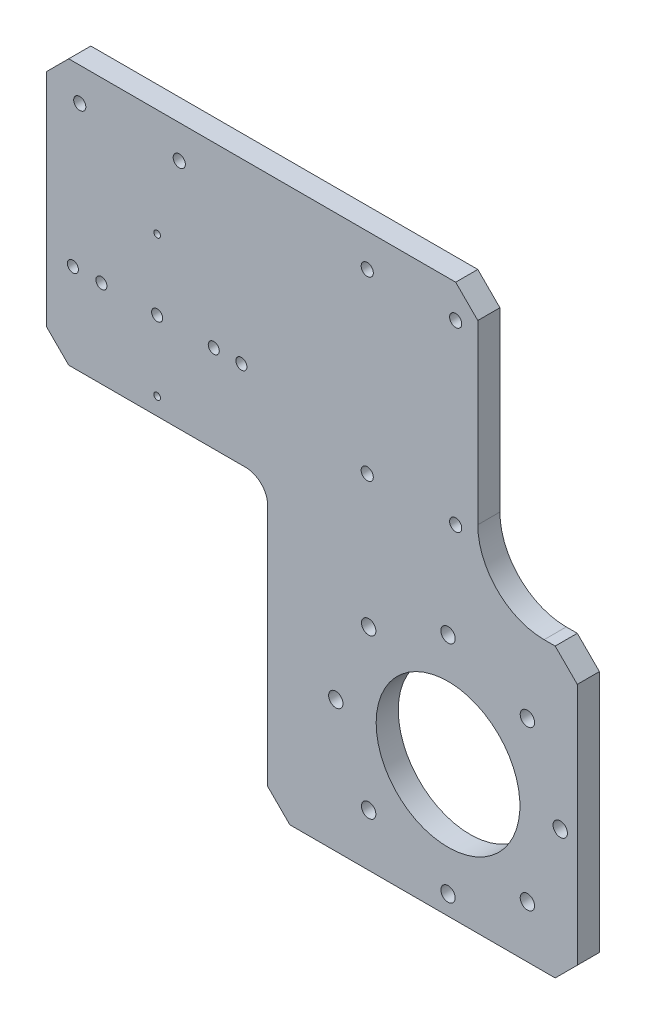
ISO-10303-21;
HEADER;
FILE_DESCRIPTION(('STEP AP214'),'2;1');
FILE_NAME('part.step','',(''),(''),'','','');
FILE_SCHEMA(('AUTOMOTIVE_DESIGN { 1 0 10303 214 1 1 1 1 }'));
ENDSEC;
DATA;
#1=APPLICATION_CONTEXT('core data for automotive mechanical design processes');
#2=APPLICATION_PROTOCOL_DEFINITION('international standard','automotive_design',2000,#1);
#3=PRODUCT_CONTEXT('',#1,'mechanical');
#4=PRODUCT('Part','Part','',(#3));
#5=PRODUCT_RELATED_PRODUCT_CATEGORY('part','',(#4));
#6=PRODUCT_DEFINITION_FORMATION('','',#4);
#7=PRODUCT_DEFINITION_CONTEXT('part definition',#1,'design');
#8=PRODUCT_DEFINITION('design','',#6,#7);
#9=PRODUCT_DEFINITION_SHAPE('','',#8);
#10=(LENGTH_UNIT() NAMED_UNIT(*) SI_UNIT(.MILLI.,.METRE.));
#11=(NAMED_UNIT(*) PLANE_ANGLE_UNIT() SI_UNIT($,.RADIAN.));
#12=(NAMED_UNIT(*) SI_UNIT($,.STERADIAN.) SOLID_ANGLE_UNIT());
#13=UNCERTAINTY_MEASURE_WITH_UNIT(LENGTH_MEASURE(1.E-05),#10,'distance_accuracy_value','');
#14=(GEOMETRIC_REPRESENTATION_CONTEXT(3) GLOBAL_UNCERTAINTY_ASSIGNED_CONTEXT((#13)) GLOBAL_UNIT_ASSIGNED_CONTEXT((#10,
#11,#12)) REPRESENTATION_CONTEXT('',''));
#15=CARTESIAN_POINT('',(0.,0.,0.));
#16=DIRECTION('',(0.,0.,1.));
#17=DIRECTION('',(1.,0.,0.));
#18=AXIS2_PLACEMENT_3D('',#15,#16,#17);
#19=CARTESIAN_POINT('',(0.,0.,0.));
#20=DIRECTION('',(0.,0.,1.));
#21=DIRECTION('',(1.,0.,0.));
#22=AXIS2_PLACEMENT_3D('',#19,#20,#21);
#23=PLANE('',#22);
#24=CARTESIAN_POINT('',(-85.2,-75.4000000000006,0.));
#25=DIRECTION('',(0.,0.,-1.));
#26=DIRECTION('',(-1.,0.,0.));
#27=AXIS2_PLACEMENT_3D('',#24,#25,#26);
#28=CIRCLE('',#27,2.49999999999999);
#29=CARTESIAN_POINT('',(-87.7,-75.4000000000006,0.));
#30=VERTEX_POINT('',#29);
#31=EDGE_CURVE('E366',#30,#30,#28,.T.);
#32=ORIENTED_EDGE('',*,*,#31,.F.);
#33=EDGE_LOOP('',(#32));
#34=FACE_BOUND('',#33,.T.);
#35=CARTESIAN_POINT('',(-60.,-75.4000000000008,0.));
#36=DIRECTION('',(0.,0.,-1.));
#37=DIRECTION('',(-1.,0.,0.));
#38=AXIS2_PLACEMENT_3D('',#35,#36,#37);
#39=CIRCLE('',#38,2.49999999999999);
#40=CARTESIAN_POINT('',(-62.5,-75.4000000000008,0.));
#41=VERTEX_POINT('',#40);
#42=EDGE_CURVE('E372',#41,#41,#39,.T.);
#43=ORIENTED_EDGE('',*,*,#42,.F.);
#44=EDGE_LOOP('',(#43));
#45=FACE_BOUND('',#44,.T.);
#46=CARTESIAN_POINT('',(-34.4,-75.4000000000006,0.));
#47=DIRECTION('',(0.,0.,-1.));
#48=DIRECTION('',(-1.,0.,0.));
#49=AXIS2_PLACEMENT_3D('',#46,#47,#48);
#50=CIRCLE('',#49,2.49999999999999);
#51=CARTESIAN_POINT('',(-36.9,-75.4000000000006,0.));
#52=VERTEX_POINT('',#51);
#53=EDGE_CURVE('E378',#52,#52,#50,.T.);
#54=ORIENTED_EDGE('',*,*,#53,.F.);
#55=EDGE_LOOP('',(#54));
#56=FACE_BOUND('',#55,.T.);
#57=CARTESIAN_POINT('',(75.,-9.99999999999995,0.));
#58=DIRECTION('',(0.,0.,-1.));
#59=DIRECTION('',(-1.,0.,0.));
#60=AXIS2_PLACEMENT_3D('',#57,#58,#59);
#61=CIRCLE('',#60,2.75000000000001);
#62=CARTESIAN_POINT('',(72.25,-9.99999999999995,0.));
#63=VERTEX_POINT('',#62);
#64=EDGE_CURVE('E401',#63,#63,#61,.T.);
#65=ORIENTED_EDGE('',*,*,#64,.F.);
#66=EDGE_LOOP('',(#65));
#67=FACE_BOUND('',#66,.T.);
#68=CARTESIAN_POINT('',(35.,-9.99999999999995,0.));
#69=DIRECTION('',(0.,0.,-1.));
#70=DIRECTION('',(-1.,0.,0.));
#71=AXIS2_PLACEMENT_3D('',#68,#69,#70);
#72=CIRCLE('',#71,2.75);
#73=CARTESIAN_POINT('',(32.25,-9.99999999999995,0.));
#74=VERTEX_POINT('',#73);
#75=EDGE_CURVE('E407',#74,#74,#72,.T.);
#76=ORIENTED_EDGE('',*,*,#75,.F.);
#77=EDGE_LOOP('',(#76));
#78=FACE_BOUND('',#77,.T.);
#79=CARTESIAN_POINT('',(35.,-90.,0.));
#80=DIRECTION('',(0.,0.,-1.));
#81=DIRECTION('',(-1.,0.,0.));
#82=AXIS2_PLACEMENT_3D('',#79,#80,#81);
#83=CIRCLE('',#82,2.75);
#84=CARTESIAN_POINT('',(32.25,-90.,0.));
#85=VERTEX_POINT('',#84);
#86=EDGE_CURVE('E413',#85,#85,#83,.T.);
#87=ORIENTED_EDGE('',*,*,#86,.F.);
#88=EDGE_LOOP('',(#87));
#89=FACE_BOUND('',#88,.T.);
#90=CARTESIAN_POINT('',(75.,-90.,0.));
#91=DIRECTION('',(0.,0.,-1.));
#92=DIRECTION('',(-1.,0.,0.));
#93=AXIS2_PLACEMENT_3D('',#90,#91,#92);
#94=CIRCLE('',#93,2.75000000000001);
#95=CARTESIAN_POINT('',(72.25,-90.,0.));
#96=VERTEX_POINT('',#95);
#97=EDGE_CURVE('E394',#96,#96,#94,.T.);
#98=ORIENTED_EDGE('',*,*,#97,.F.);
#99=EDGE_LOOP('',(#98));
#100=FACE_BOUND('',#99,.T.);
#101=CARTESIAN_POINT('',(-50.,-9.99999999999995,0.));
#102=DIRECTION('',(0.,0.,-1.));
#103=DIRECTION('',(-1.,0.,0.));
#104=AXIS2_PLACEMENT_3D('',#101,#102,#103);
#105=CIRCLE('',#104,2.75);
#106=CARTESIAN_POINT('',(-52.75,-9.99999999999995,0.));
#107=VERTEX_POINT('',#106);
#108=EDGE_CURVE('E384',#107,#107,#105,.T.);
#109=ORIENTED_EDGE('',*,*,#108,.F.);
#110=EDGE_LOOP('',(#109));
#111=FACE_BOUND('',#110,.T.);
#112=CARTESIAN_POINT('',(-95.,-9.99999999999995,0.));
#113=DIRECTION('',(0.,0.,-1.));
#114=DIRECTION('',(-1.,0.,0.));
#115=AXIS2_PLACEMENT_3D('',#112,#113,#114);
#116=CIRCLE('',#115,2.75000000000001);
#117=CARTESIAN_POINT('',(-97.75,-9.99999999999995,0.));
#118=VERTEX_POINT('',#117);
#119=EDGE_CURVE('E388',#118,#118,#116,.T.);
#120=ORIENTED_EDGE('',*,*,#119,.F.);
#121=EDGE_LOOP('',(#120));
#122=FACE_BOUND('',#121,.T.);
#123=CARTESIAN_POINT('',(71.5399999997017,-134.789999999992,0.));
#124=DIRECTION('',(0.,0.,1.));
#125=DIRECTION('',(1.,0.,0.));
#126=AXIS2_PLACEMENT_3D('',#123,#124,#125);
#127=CIRCLE('',#126,3.25000000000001);
#128=CARTESIAN_POINT('',(74.7899999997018,-134.789999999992,0.));
#129=VERTEX_POINT('',#128);
#130=EDGE_CURVE('E446',#129,#129,#127,.T.);
#131=ORIENTED_EDGE('',*,*,#130,.T.);
#132=EDGE_LOOP('',(#131));
#133=FACE_BOUND('',#132,.T.);
#134=CARTESIAN_POINT('',(107.42566914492,-221.42566914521,0.));
#135=DIRECTION('',(0.,0.,1.));
#136=DIRECTION('',(1.,0.,0.));
#137=AXIS2_PLACEMENT_3D('',#134,#135,#136);
#138=CIRCLE('',#137,3.25000000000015);
#139=CARTESIAN_POINT('',(110.67566914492,-221.42566914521,0.));
#140=VERTEX_POINT('',#139);
#141=EDGE_CURVE('E439',#140,#140,#138,.T.);
#142=ORIENTED_EDGE('',*,*,#141,.T.);
#143=EDGE_LOOP('',(#142));
#144=FACE_BOUND('',#143,.T.);
#145=CARTESIAN_POINT('',(122.289999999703,-185.539999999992,0.));
#146=DIRECTION('',(0.,0.,1.));
#147=DIRECTION('',(1.,0.,0.));
#148=AXIS2_PLACEMENT_3D('',#145,#146,#147);
#149=CIRCLE('',#148,3.24999999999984);
#150=CARTESIAN_POINT('',(125.539999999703,-185.539999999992,0.));
#151=VERTEX_POINT('',#150);
#152=EDGE_CURVE('E458',#151,#151,#149,.T.);
#153=ORIENTED_EDGE('',*,*,#152,.T.);
#154=EDGE_LOOP('',(#153));
#155=FACE_BOUND('',#154,.T.);
#156=CARTESIAN_POINT('',(71.539999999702,-236.289999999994,0.));
#157=DIRECTION('',(0.,0.,1.));
#158=DIRECTION('',(1.,0.,0.));
#159=AXIS2_PLACEMENT_3D('',#156,#157,#158);
#160=CIRCLE('',#159,3.25000000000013);
#161=CARTESIAN_POINT('',(74.7899999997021,-236.289999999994,0.));
#162=VERTEX_POINT('',#161);
#163=EDGE_CURVE('E451',#162,#162,#160,.T.);
#164=ORIENTED_EDGE('',*,*,#163,.T.);
#165=EDGE_LOOP('',(#164));
#166=FACE_BOUND('',#165,.T.);
#167=CARTESIAN_POINT('',(35.6543308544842,-149.654330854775,0.));
#168=DIRECTION('',(0.,0.,1.));
#169=DIRECTION('',(1.,0.,0.));
#170=AXIS2_PLACEMENT_3D('',#167,#168,#169);
#171=CIRCLE('',#170,3.25000000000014);
#172=CARTESIAN_POINT('',(38.9043308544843,-149.654330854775,0.));
#173=VERTEX_POINT('',#172);
#174=EDGE_CURVE('E421',#173,#173,#171,.T.);
#175=ORIENTED_EDGE('',*,*,#174,.T.);
#176=EDGE_LOOP('',(#175));
#177=FACE_BOUND('',#176,.T.);
#178=CARTESIAN_POINT('',(20.7899999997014,-185.539999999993,0.));
#179=DIRECTION('',(0.,0.,1.));
#180=DIRECTION('',(1.,0.,0.));
#181=AXIS2_PLACEMENT_3D('',#178,#179,#180);
#182=CIRCLE('',#181,3.25000000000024);
#183=CARTESIAN_POINT('',(24.0399999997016,-185.539999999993,0.));
#184=VERTEX_POINT('',#183);
#185=EDGE_CURVE('E428',#184,#184,#182,.T.);
#186=ORIENTED_EDGE('',*,*,#185,.T.);
#187=EDGE_LOOP('',(#186));
#188=FACE_BOUND('',#187,.T.);
#189=CARTESIAN_POINT('',(107.425669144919,-149.654330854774,0.));
#190=DIRECTION('',(0.,0.,1.));
#191=DIRECTION('',(1.,0.,0.));
#192=AXIS2_PLACEMENT_3D('',#189,#190,#191);
#193=CIRCLE('',#192,3.24999999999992);
#194=CARTESIAN_POINT('',(110.675669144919,-149.654330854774,0.));
#195=VERTEX_POINT('',#194);
#196=EDGE_CURVE('E434',#195,#195,#193,.T.);
#197=ORIENTED_EDGE('',*,*,#196,.T.);
#198=EDGE_LOOP('',(#197));
#199=FACE_BOUND('',#198,.T.);
#200=CARTESIAN_POINT('',(35.6543308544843,-221.425669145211,0.));
#201=DIRECTION('',(0.,0.,1.));
#202=DIRECTION('',(1.,0.,0.));
#203=AXIS2_PLACEMENT_3D('',#200,#201,#202);
#204=CIRCLE('',#203,3.25000000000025);
#205=CARTESIAN_POINT('',(38.9043308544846,-221.425669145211,0.));
#206=VERTEX_POINT('',#205);
#207=EDGE_CURVE('E191',#206,#206,#204,.T.);
#208=ORIENTED_EDGE('',*,*,#207,.T.);
#209=EDGE_LOOP('',(#208));
#210=FACE_BOUND('',#209,.T.);
#211=CARTESIAN_POINT('',(71.539999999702,-185.539999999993,0.));
#212=DIRECTION('',(0.,0.,-1.));
#213=DIRECTION('',(-1.,0.,0.));
#214=AXIS2_PLACEMENT_3D('',#211,#212,#213);
#215=CIRCLE('',#214,32.5);
#216=CARTESIAN_POINT('',(39.039999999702,-185.539999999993,0.));
#217=VERTEX_POINT('',#216);
#218=EDGE_CURVE('E200',#217,#217,#215,.T.);
#219=ORIENTED_EDGE('',*,*,#218,.F.);
#220=EDGE_LOOP('',(#219));
#221=FACE_BOUND('',#220,.T.);
#222=CARTESIAN_POINT('',(-60.,-43.6500000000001,0.));
#223=DIRECTION('',(0.,0.,-1.));
#224=DIRECTION('',(-1.,0.,0.));
#225=AXIS2_PLACEMENT_3D('',#222,#223,#224);
#226=CIRCLE('',#225,1.5);
#227=CARTESIAN_POINT('',(-61.5,-43.6500000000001,0.));
#228=VERTEX_POINT('',#227);
#229=EDGE_CURVE('E220',#228,#228,#226,.T.);
#230=ORIENTED_EDGE('',*,*,#229,.F.);
#231=EDGE_LOOP('',(#230));
#232=FACE_BOUND('',#231,.T.);
#233=CARTESIAN_POINT('',(-98.1,-75.4,0.));
#234=DIRECTION('',(0.,0.,-1.));
#235=DIRECTION('',(-1.,0.,0.));
#236=AXIS2_PLACEMENT_3D('',#233,#234,#235);
#237=CIRCLE('',#236,2.5);
#238=CARTESIAN_POINT('',(-100.6,-75.4,0.));
#239=VERTEX_POINT('',#238);
#240=EDGE_CURVE('E232',#239,#239,#237,.T.);
#241=ORIENTED_EDGE('',*,*,#240,.F.);
#242=EDGE_LOOP('',(#241));
#243=FACE_BOUND('',#242,.T.);
#244=CARTESIAN_POINT('',(-21.9,-75.4,0.));
#245=DIRECTION('',(0.,0.,-1.));
#246=DIRECTION('',(-1.,0.,0.));
#247=AXIS2_PLACEMENT_3D('',#244,#245,#246);
#248=CIRCLE('',#247,2.5);
#249=CARTESIAN_POINT('',(-24.4,-75.4,0.));
#250=VERTEX_POINT('',#249);
#251=EDGE_CURVE('E226',#250,#250,#248,.T.);
#252=ORIENTED_EDGE('',*,*,#251,.F.);
#253=EDGE_LOOP('',(#252));
#254=FACE_BOUND('',#253,.T.);
#255=CARTESIAN_POINT('',(-60.,-107.15,0.));
#256=DIRECTION('',(0.,0.,-1.));
#257=DIRECTION('',(-1.,0.,0.));
#258=AXIS2_PLACEMENT_3D('',#255,#256,#257);
#259=CIRCLE('',#258,1.5);
#260=CARTESIAN_POINT('',(-61.5,-107.15,0.));
#261=VERTEX_POINT('',#260);
#262=EDGE_CURVE('E214',#261,#261,#259,.T.);
#263=ORIENTED_EDGE('',*,*,#262,.F.);
#264=EDGE_LOOP('',(#263));
#265=FACE_BOUND('',#264,.T.);
#266=DIRECTION('',(-1.,0.,0.));
#267=VECTOR('',#266,1.);
#268=CARTESIAN_POINT('',(130.,-115.,0.));
#269=LINE('',#268,#267);
#270=CARTESIAN_POINT('',(120.,-115.,0.));
#271=VERTEX_POINT('',#270);
#272=CARTESIAN_POINT('',(115.,-115.,0.));
#273=VERTEX_POINT('',#272);
#274=EDGE_CURVE('E356',#271,#273,#269,.T.);
#275=ORIENTED_EDGE('',*,*,#274,.F.);
#276=DIRECTION('',(0.707106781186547,-0.707106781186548,0.));
#277=VECTOR('',#276,1.);
#278=CARTESIAN_POINT('',(120.,-115.,0.));
#279=LINE('',#278,#277);
#280=CARTESIAN_POINT('',(130.,-125.,0.));
#281=VERTEX_POINT('',#280);
#282=EDGE_CURVE('E300',#271,#281,#279,.T.);
#283=ORIENTED_EDGE('',*,*,#282,.T.);
#284=DIRECTION('',(0.,1.,0.));
#285=VECTOR('',#284,1.);
#286=CARTESIAN_POINT('',(130.,-245.,0.));
#287=LINE('',#286,#285);
#288=CARTESIAN_POINT('',(130.,-235.,0.));
#289=VERTEX_POINT('',#288);
#290=EDGE_CURVE('E195',#289,#281,#287,.T.);
#291=ORIENTED_EDGE('',*,*,#290,.F.);
#292=DIRECTION('',(0.707106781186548,0.707106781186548,0.));
#293=VECTOR('',#292,1.);
#294=CARTESIAN_POINT('',(130.,-235.,0.));
#295=LINE('',#294,#293);
#296=CARTESIAN_POINT('',(120.,-245.,0.));
#297=VERTEX_POINT('',#296);
#298=EDGE_CURVE('E266',#289,#297,#295,.F.);
#299=ORIENTED_EDGE('',*,*,#298,.T.);
#300=DIRECTION('',(1.,0.,0.));
#301=VECTOR('',#300,1.);
#302=CARTESIAN_POINT('',(-110.,-245.,0.));
#303=LINE('',#302,#301);
#304=CARTESIAN_POINT('',(0.,-245.,0.));
#305=VERTEX_POINT('',#304);
#306=EDGE_CURVE('E208',#305,#297,#303,.T.);
#307=ORIENTED_EDGE('',*,*,#306,.F.);
#308=DIRECTION('',(-0.707106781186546,0.70710678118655,0.));
#309=VECTOR('',#308,1.);
#310=CARTESIAN_POINT('',(0.,-245.,0.));
#311=LINE('',#310,#309);
#312=CARTESIAN_POINT('',(-9.99999999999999,-235.,0.));
#313=VERTEX_POINT('',#312);
#314=EDGE_CURVE('E186',#305,#313,#311,.T.);
#315=ORIENTED_EDGE('',*,*,#314,.T.);
#316=DIRECTION('',(0.,-1.,0.));
#317=VECTOR('',#316,1.);
#318=CARTESIAN_POINT('',(-9.99999999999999,-245.,0.));
#319=LINE('',#318,#317);
#320=CARTESIAN_POINT('',(-9.99999999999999,-125.,0.));
#321=VERTEX_POINT('',#320);
#322=EDGE_CURVE('E178',#321,#313,#319,.T.);
#323=ORIENTED_EDGE('',*,*,#322,.F.);
#324=CARTESIAN_POINT('',(-20.,-125.,0.));
#325=DIRECTION('',(0.,0.,1.));
#326=DIRECTION('',(1.,0.,0.));
#327=AXIS2_PLACEMENT_3D('',#324,#325,#326);
#328=CIRCLE('',#327,10.);
#329=CARTESIAN_POINT('',(-20.,-115.,0.));
#330=VERTEX_POINT('',#329);
#331=EDGE_CURVE('E162',#321,#330,#328,.T.);
#332=ORIENTED_EDGE('',*,*,#331,.T.);
#333=DIRECTION('',(1.,0.,0.));
#334=VECTOR('',#333,1.);
#335=CARTESIAN_POINT('',(-110.,-115.,0.));
#336=LINE('',#335,#334);
#337=CARTESIAN_POINT('',(-100.,-115.,0.));
#338=VERTEX_POINT('',#337);
#339=EDGE_CURVE('E188',#338,#330,#336,.T.);
#340=ORIENTED_EDGE('',*,*,#339,.F.);
#341=DIRECTION('',(0.707106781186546,-0.707106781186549,0.));
#342=VECTOR('',#341,1.);
#343=CARTESIAN_POINT('',(-100.,-115.,0.));
#344=LINE('',#343,#342);
#345=CARTESIAN_POINT('',(-110.,-105.,0.));
#346=VERTEX_POINT('',#345);
#347=EDGE_CURVE('E263',#338,#346,#344,.F.);
#348=ORIENTED_EDGE('',*,*,#347,.T.);
#349=DIRECTION('',(0.,-1.,0.));
#350=VECTOR('',#349,1.);
#351=CARTESIAN_POINT('',(-110.,-125.,0.));
#352=LINE('',#351,#350);
#353=CARTESIAN_POINT('',(-110.,-5.0000000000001,0.));
#354=VERTEX_POINT('',#353);
#355=EDGE_CURVE('E238',#354,#346,#352,.T.);
#356=ORIENTED_EDGE('',*,*,#355,.F.);
#357=DIRECTION('',(0.707106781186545,0.70710678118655,0.));
#358=VECTOR('',#357,1.);
#359=CARTESIAN_POINT('',(-100.,4.99999999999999,0.));
#360=LINE('',#359,#358);
#361=CARTESIAN_POINT('',(-100.,4.99999999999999,0.));
#362=VERTEX_POINT('',#361);
#363=EDGE_CURVE('E268',#354,#362,#360,.T.);
#364=ORIENTED_EDGE('',*,*,#363,.T.);
#365=DIRECTION('',(-1.,0.,0.));
#366=VECTOR('',#365,1.);
#367=CARTESIAN_POINT('',(110.,5.00000000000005,0.));
#368=LINE('',#367,#366);
#369=CARTESIAN_POINT('',(75.,5.00000000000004,0.));
#370=VERTEX_POINT('',#369);
#371=EDGE_CURVE('E204',#370,#362,#368,.T.);
#372=ORIENTED_EDGE('',*,*,#371,.F.);
#373=DIRECTION('',(0.707106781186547,-0.707106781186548,0.));
#374=VECTOR('',#373,1.);
#375=CARTESIAN_POINT('',(75.,5.00000000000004,0.));
#376=LINE('',#375,#374);
#377=CARTESIAN_POINT('',(85.,-4.99999999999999,0.));
#378=VERTEX_POINT('',#377);
#379=EDGE_CURVE('E298',#370,#378,#376,.T.);
#380=ORIENTED_EDGE('',*,*,#379,.T.);
#381=DIRECTION('',(0.,1.,0.));
#382=VECTOR('',#381,1.);
#383=CARTESIAN_POINT('',(85.,-115.,0.));
#384=LINE('',#383,#382);
#385=CARTESIAN_POINT('',(85.,-85.,0.));
#386=VERTEX_POINT('',#385);
#387=EDGE_CURVE('E359',#386,#378,#384,.T.);
#388=ORIENTED_EDGE('',*,*,#387,.F.);
#389=CARTESIAN_POINT('',(115.,-85.,0.));
#390=DIRECTION('',(0.,0.,1.));
#391=DIRECTION('',(1.,0.,0.));
#392=AXIS2_PLACEMENT_3D('',#389,#390,#391);
#393=CIRCLE('',#392,30.);
#394=EDGE_CURVE('E290',#386,#273,#393,.T.);
#395=ORIENTED_EDGE('',*,*,#394,.T.);
#396=EDGE_LOOP('',(#275,#283,#291,#299,#307,#315,#323,#332,#340,#348,#356,#364,#372,#380,#388,#395));
#397=FACE_BOUND('',#396,.T.);
#398=ADVANCED_FACE('F47',(#34,#45,#56,#67,#78,#89,#100,#111,#122,#133,#144,#155,#166,#177,#188,
#199,#210,#221,#232,#243,#254,#265,#397),#23,.F.);
#399=CARTESIAN_POINT('',(-110.,-125.,10.));
#400=DIRECTION('',(1.,0.,0.));
#401=DIRECTION('',(0.,0.,-1.));
#402=AXIS2_PLACEMENT_3D('',#399,#400,#401);
#403=PLANE('',#402);
#404=DIRECTION('',(0.,-1.,0.));
#405=VECTOR('',#404,1.);
#406=CARTESIAN_POINT('',(-110.,-125.,10.));
#407=LINE('',#406,#405);
#408=CARTESIAN_POINT('',(-110.,-5.0000000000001,10.));
#409=VERTEX_POINT('',#408);
#410=CARTESIAN_POINT('',(-110.,-105.,10.));
#411=VERTEX_POINT('',#410);
#412=EDGE_CURVE('E182',#409,#411,#407,.T.);
#413=ORIENTED_EDGE('',*,*,#412,.F.);
#414=DIRECTION('',(0.,0.,-1.));
#415=VECTOR('',#414,1.);
#416=CARTESIAN_POINT('',(-110.,-5.0000000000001,0.));
#417=LINE('',#416,#415);
#418=EDGE_CURVE('E261',#409,#354,#417,.T.);
#419=ORIENTED_EDGE('',*,*,#418,.T.);
#420=ORIENTED_EDGE('',*,*,#355,.T.);
#421=DIRECTION('',(0.,0.,1.));
#422=VECTOR('',#421,1.);
#423=CARTESIAN_POINT('',(-110.,-105.,10.));
#424=LINE('',#423,#422);
#425=EDGE_CURVE('E259',#346,#411,#424,.T.);
#426=ORIENTED_EDGE('',*,*,#425,.T.);
#427=EDGE_LOOP('',(#413,#419,#420,#426));
#428=FACE_BOUND('',#427,.T.);
#429=ADVANCED_FACE('F325',(#428),#403,.F.);
#430=CARTESIAN_POINT('',(0.,0.,10.));
#431=DIRECTION('',(0.,0.,1.));
#432=DIRECTION('',(1.,0.,0.));
#433=AXIS2_PLACEMENT_3D('',#430,#431,#432);
#434=PLANE('',#433);
#435=DIRECTION('',(0.,-1.,0.));
#436=VECTOR('',#435,1.);
#437=CARTESIAN_POINT('',(130.,5.00000000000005,10.));
#438=LINE('',#437,#436);
#439=CARTESIAN_POINT('',(130.,-125.,10.));
#440=VERTEX_POINT('',#439);
#441=CARTESIAN_POINT('',(130.,-235.,10.));
#442=VERTEX_POINT('',#441);
#443=EDGE_CURVE('E198',#440,#442,#438,.T.);
#444=ORIENTED_EDGE('',*,*,#443,.F.);
#445=DIRECTION('',(-0.707106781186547,0.707106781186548,0.));
#446=VECTOR('',#445,1.);
#447=CARTESIAN_POINT('',(2.50000000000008,2.50000000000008,10.));
#448=LINE('',#447,#446);
#449=CARTESIAN_POINT('',(120.,-115.,10.));
#450=VERTEX_POINT('',#449);
#451=EDGE_CURVE('E305',#440,#450,#448,.T.);
#452=ORIENTED_EDGE('',*,*,#451,.T.);
#453=DIRECTION('',(-1.,0.,0.));
#454=VECTOR('',#453,1.);
#455=CARTESIAN_POINT('',(130.,-115.,10.));
#456=LINE('',#455,#454);
#457=CARTESIAN_POINT('',(115.,-115.,10.));
#458=VERTEX_POINT('',#457);
#459=EDGE_CURVE('E357',#450,#458,#456,.T.);
#460=ORIENTED_EDGE('',*,*,#459,.T.);
#461=CARTESIAN_POINT('',(115.,-85.,10.));
#462=DIRECTION('',(0.,0.,1.));
#463=DIRECTION('',(1.,0.,0.));
#464=AXIS2_PLACEMENT_3D('',#461,#462,#463);
#465=CIRCLE('',#464,30.);
#466=CARTESIAN_POINT('',(85.,-85.,10.));
#467=VERTEX_POINT('',#466);
#468=EDGE_CURVE('E293',#458,#467,#465,.F.);
#469=ORIENTED_EDGE('',*,*,#468,.T.);
#470=DIRECTION('',(0.,1.,0.));
#471=VECTOR('',#470,1.);
#472=CARTESIAN_POINT('',(85.,-115.,10.));
#473=LINE('',#472,#471);
#474=CARTESIAN_POINT('',(85.,-4.99999999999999,10.));
#475=VERTEX_POINT('',#474);
#476=EDGE_CURVE('E363',#467,#475,#473,.T.);
#477=ORIENTED_EDGE('',*,*,#476,.T.);
#478=DIRECTION('',(-0.707106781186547,0.707106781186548,0.));
#479=VECTOR('',#478,1.);
#480=CARTESIAN_POINT('',(40.0000000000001,40.,10.));
#481=LINE('',#480,#479);
#482=CARTESIAN_POINT('',(75.,5.00000000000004,10.));
#483=VERTEX_POINT('',#482);
#484=EDGE_CURVE('E62',#475,#483,#481,.T.);
#485=ORIENTED_EDGE('',*,*,#484,.T.);
#486=DIRECTION('',(1.,0.,0.));
#487=VECTOR('',#486,1.);
#488=CARTESIAN_POINT('',(-110.,4.99999999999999,10.));
#489=LINE('',#488,#487);
#490=CARTESIAN_POINT('',(-100.,4.99999999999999,10.));
#491=VERTEX_POINT('',#490);
#492=EDGE_CURVE('E206',#491,#483,#489,.T.);
#493=ORIENTED_EDGE('',*,*,#492,.F.);
#494=DIRECTION('',(-0.707106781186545,-0.70710678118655,0.));
#495=VECTOR('',#494,1.);
#496=CARTESIAN_POINT('',(-52.5000000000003,52.5,10.));
#497=LINE('',#496,#495);
#498=EDGE_CURVE('E257',#491,#409,#497,.T.);
#499=ORIENTED_EDGE('',*,*,#498,.T.);
#500=ORIENTED_EDGE('',*,*,#412,.T.);
#501=DIRECTION('',(-0.707106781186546,0.707106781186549,0.));
#502=VECTOR('',#501,1.);
#503=CARTESIAN_POINT('',(-107.5,-107.5,10.));
#504=LINE('',#503,#502);
#505=CARTESIAN_POINT('',(-100.,-115.,10.));
#506=VERTEX_POINT('',#505);
#507=EDGE_CURVE('E250',#411,#506,#504,.F.);
#508=ORIENTED_EDGE('',*,*,#507,.T.);
#509=DIRECTION('',(1.,0.,0.));
#510=VECTOR('',#509,1.);
#511=CARTESIAN_POINT('',(-110.,-115.,10.));
#512=LINE('',#511,#510);
#513=CARTESIAN_POINT('',(-20.,-115.,10.));
#514=VERTEX_POINT('',#513);
#515=EDGE_CURVE('E187',#506,#514,#512,.T.);
#516=ORIENTED_EDGE('',*,*,#515,.T.);
#517=CARTESIAN_POINT('',(-20.,-125.,10.));
#518=DIRECTION('',(0.,0.,1.));
#519=DIRECTION('',(1.,0.,0.));
#520=AXIS2_PLACEMENT_3D('',#517,#518,#519);
#521=CIRCLE('',#520,10.);
#522=CARTESIAN_POINT('',(-9.99999999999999,-125.,10.));
#523=VERTEX_POINT('',#522);
#524=EDGE_CURVE('E172',#514,#523,#521,.F.);
#525=ORIENTED_EDGE('',*,*,#524,.T.);
#526=DIRECTION('',(0.,-1.,0.));
#527=VECTOR('',#526,1.);
#528=CARTESIAN_POINT('',(-9.99999999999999,-245.,10.));
#529=LINE('',#528,#527);
#530=CARTESIAN_POINT('',(-9.99999999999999,-235.,10.));
#531=VERTEX_POINT('',#530);
#532=EDGE_CURVE('E181',#523,#531,#529,.T.);
#533=ORIENTED_EDGE('',*,*,#532,.T.);
#534=DIRECTION('',(0.707106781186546,-0.70710678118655,0.));
#535=VECTOR('',#534,1.);
#536=CARTESIAN_POINT('',(-122.5,-122.499999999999,10.));
#537=LINE('',#536,#535);
#538=CARTESIAN_POINT('',(0.,-245.,10.));
#539=VERTEX_POINT('',#538);
#540=EDGE_CURVE('E252',#531,#539,#537,.T.);
#541=ORIENTED_EDGE('',*,*,#540,.T.);
#542=DIRECTION('',(-1.,0.,0.));
#543=VECTOR('',#542,1.);
#544=CARTESIAN_POINT('',(110.,-245.,10.));
#545=LINE('',#544,#543);
#546=CARTESIAN_POINT('',(120.,-245.,10.));
#547=VERTEX_POINT('',#546);
#548=EDGE_CURVE('E211',#547,#539,#545,.T.);
#549=ORIENTED_EDGE('',*,*,#548,.F.);
#550=DIRECTION('',(-0.707106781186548,-0.707106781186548,0.));
#551=VECTOR('',#550,1.);
#552=CARTESIAN_POINT('',(182.5,-182.5,10.));
#553=LINE('',#552,#551);
#554=EDGE_CURVE('E254',#547,#442,#553,.F.);
#555=ORIENTED_EDGE('',*,*,#554,.T.);
#556=EDGE_LOOP('',(#444,#452,#460,#469,#477,#485,#493,#499,#500,#508,#516,#525,#533,#541,#549,#555));
#557=FACE_BOUND('',#556,.T.);
#558=CARTESIAN_POINT('',(-85.2,-75.4000000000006,9.99999999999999));
#559=DIRECTION('',(0.,0.,-1.));
#560=DIRECTION('',(-1.,0.,0.));
#561=AXIS2_PLACEMENT_3D('',#558,#559,#560);
#562=CIRCLE('',#561,2.49999999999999);
#563=CARTESIAN_POINT('',(-87.7,-75.4000000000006,9.99999999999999));
#564=VERTEX_POINT('',#563);
#565=EDGE_CURVE('E369',#564,#564,#562,.T.);
#566=ORIENTED_EDGE('',*,*,#565,.T.);
#567=EDGE_LOOP('',(#566));
#568=FACE_BOUND('',#567,.T.);
#569=CARTESIAN_POINT('',(-60.,-75.4000000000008,9.99999999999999));
#570=DIRECTION('',(0.,0.,-1.));
#571=DIRECTION('',(-1.,0.,0.));
#572=AXIS2_PLACEMENT_3D('',#569,#570,#571);
#573=CIRCLE('',#572,2.49999999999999);
#574=CARTESIAN_POINT('',(-62.5,-75.4000000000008,9.99999999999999));
#575=VERTEX_POINT('',#574);
#576=EDGE_CURVE('E375',#575,#575,#573,.T.);
#577=ORIENTED_EDGE('',*,*,#576,.T.);
#578=EDGE_LOOP('',(#577));
#579=FACE_BOUND('',#578,.T.);
#580=CARTESIAN_POINT('',(-34.4,-75.4000000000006,9.99999999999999));
#581=DIRECTION('',(0.,0.,-1.));
#582=DIRECTION('',(-1.,0.,0.));
#583=AXIS2_PLACEMENT_3D('',#580,#581,#582);
#584=CIRCLE('',#583,2.49999999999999);
#585=CARTESIAN_POINT('',(-36.9,-75.4000000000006,9.99999999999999));
#586=VERTEX_POINT('',#585);
#587=EDGE_CURVE('E381',#586,#586,#584,.T.);
#588=ORIENTED_EDGE('',*,*,#587,.T.);
#589=EDGE_LOOP('',(#588));
#590=FACE_BOUND('',#589,.T.);
#591=CARTESIAN_POINT('',(75.,-9.99999999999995,10.));
#592=DIRECTION('',(0.,0.,-1.));
#593=DIRECTION('',(-1.,0.,0.));
#594=AXIS2_PLACEMENT_3D('',#591,#592,#593);
#595=CIRCLE('',#594,2.75000000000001);
#596=CARTESIAN_POINT('',(72.25,-9.99999999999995,10.));
#597=VERTEX_POINT('',#596);
#598=EDGE_CURVE('E397',#597,#597,#595,.T.);
#599=ORIENTED_EDGE('',*,*,#598,.T.);
#600=EDGE_LOOP('',(#599));
#601=FACE_BOUND('',#600,.T.);
#602=CARTESIAN_POINT('',(35.,-9.99999999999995,10.));
#603=DIRECTION('',(0.,0.,-1.));
#604=DIRECTION('',(-1.,0.,0.));
#605=AXIS2_PLACEMENT_3D('',#602,#603,#604);
#606=CIRCLE('',#605,2.75);
#607=CARTESIAN_POINT('',(32.25,-9.99999999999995,10.));
#608=VERTEX_POINT('',#607);
#609=EDGE_CURVE('E404',#608,#608,#606,.T.);
#610=ORIENTED_EDGE('',*,*,#609,.T.);
#611=EDGE_LOOP('',(#610));
#612=FACE_BOUND('',#611,.T.);
#613=CARTESIAN_POINT('',(35.,-90.,10.));
#614=DIRECTION('',(0.,0.,-1.));
#615=DIRECTION('',(-1.,0.,0.));
#616=AXIS2_PLACEMENT_3D('',#613,#614,#615);
#617=CIRCLE('',#616,2.75);
#618=CARTESIAN_POINT('',(32.25,-90.,10.));
#619=VERTEX_POINT('',#618);
#620=EDGE_CURVE('E410',#619,#619,#617,.T.);
#621=ORIENTED_EDGE('',*,*,#620,.T.);
#622=EDGE_LOOP('',(#621));
#623=FACE_BOUND('',#622,.T.);
#624=CARTESIAN_POINT('',(75.,-90.,10.));
#625=DIRECTION('',(0.,0.,-1.));
#626=DIRECTION('',(-1.,0.,0.));
#627=AXIS2_PLACEMENT_3D('',#624,#625,#626);
#628=CIRCLE('',#627,2.75000000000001);
#629=CARTESIAN_POINT('',(72.25,-90.,10.));
#630=VERTEX_POINT('',#629);
#631=EDGE_CURVE('E416',#630,#630,#628,.T.);
#632=ORIENTED_EDGE('',*,*,#631,.T.);
#633=EDGE_LOOP('',(#632));
#634=FACE_BOUND('',#633,.T.);
#635=CARTESIAN_POINT('',(-50.,-9.99999999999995,10.));
#636=DIRECTION('',(0.,0.,-1.));
#637=DIRECTION('',(-1.,0.,0.));
#638=AXIS2_PLACEMENT_3D('',#635,#636,#637);
#639=CIRCLE('',#638,2.75);
#640=CARTESIAN_POINT('',(-52.75,-9.99999999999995,10.));
#641=VERTEX_POINT('',#640);
#642=EDGE_CURVE('E385',#641,#641,#639,.T.);
#643=ORIENTED_EDGE('',*,*,#642,.T.);
#644=EDGE_LOOP('',(#643));
#645=FACE_BOUND('',#644,.T.);
#646=CARTESIAN_POINT('',(-95.,-9.99999999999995,10.));
#647=DIRECTION('',(0.,0.,-1.));
#648=DIRECTION('',(-1.,0.,0.));
#649=AXIS2_PLACEMENT_3D('',#646,#647,#648);
#650=CIRCLE('',#649,2.75000000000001);
#651=CARTESIAN_POINT('',(-97.75,-9.99999999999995,10.));
#652=VERTEX_POINT('',#651);
#653=EDGE_CURVE('E391',#652,#652,#650,.T.);
#654=ORIENTED_EDGE('',*,*,#653,.T.);
#655=EDGE_LOOP('',(#654));
#656=FACE_BOUND('',#655,.T.);
#657=CARTESIAN_POINT('',(71.5399999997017,-134.789999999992,10.));
#658=DIRECTION('',(0.,0.,1.));
#659=DIRECTION('',(1.,0.,0.));
#660=AXIS2_PLACEMENT_3D('',#657,#658,#659);
#661=CIRCLE('',#660,3.25000000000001);
#662=CARTESIAN_POINT('',(74.7899999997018,-134.789999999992,10.));
#663=VERTEX_POINT('',#662);
#664=EDGE_CURVE('E424',#663,#663,#661,.T.);
#665=ORIENTED_EDGE('',*,*,#664,.F.);
#666=EDGE_LOOP('',(#665));
#667=FACE_BOUND('',#666,.T.);
#668=CARTESIAN_POINT('',(107.42566914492,-221.42566914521,10.));
#669=DIRECTION('',(0.,0.,1.));
#670=DIRECTION('',(1.,0.,0.));
#671=AXIS2_PLACEMENT_3D('',#668,#669,#670);
#672=CIRCLE('',#671,3.25000000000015);
#673=CARTESIAN_POINT('',(110.67566914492,-221.42566914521,10.));
#674=VERTEX_POINT('',#673);
#675=EDGE_CURVE('E443',#674,#674,#672,.T.);
#676=ORIENTED_EDGE('',*,*,#675,.F.);
#677=EDGE_LOOP('',(#676));
#678=FACE_BOUND('',#677,.T.);
#679=CARTESIAN_POINT('',(122.289999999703,-185.539999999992,10.));
#680=DIRECTION('',(0.,0.,1.));
#681=DIRECTION('',(1.,0.,0.));
#682=AXIS2_PLACEMENT_3D('',#679,#680,#681);
#683=CIRCLE('',#682,3.24999999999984);
#684=CARTESIAN_POINT('',(125.539999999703,-185.539999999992,10.));
#685=VERTEX_POINT('',#684);
#686=EDGE_CURVE('E442',#685,#685,#683,.T.);
#687=ORIENTED_EDGE('',*,*,#686,.F.);
#688=EDGE_LOOP('',(#687));
#689=FACE_BOUND('',#688,.T.);
#690=CARTESIAN_POINT('',(71.539999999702,-236.289999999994,10.));
#691=DIRECTION('',(0.,0.,1.));
#692=DIRECTION('',(1.,0.,0.));
#693=AXIS2_PLACEMENT_3D('',#690,#691,#692);
#694=CIRCLE('',#693,3.25000000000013);
#695=CARTESIAN_POINT('',(74.7899999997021,-236.289999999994,10.));
#696=VERTEX_POINT('',#695);
#697=EDGE_CURVE('E455',#696,#696,#694,.T.);
#698=ORIENTED_EDGE('',*,*,#697,.F.);
#699=EDGE_LOOP('',(#698));
#700=FACE_BOUND('',#699,.T.);
#701=CARTESIAN_POINT('',(35.6543308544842,-149.654330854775,10.));
#702=DIRECTION('',(0.,0.,1.));
#703=DIRECTION('',(1.,0.,0.));
#704=AXIS2_PLACEMENT_3D('',#701,#702,#703);
#705=CIRCLE('',#704,3.25000000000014);
#706=CARTESIAN_POINT('',(38.9043308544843,-149.654330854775,10.));
#707=VERTEX_POINT('',#706);
#708=EDGE_CURVE('E425',#707,#707,#705,.T.);
#709=ORIENTED_EDGE('',*,*,#708,.F.);
#710=EDGE_LOOP('',(#709));
#711=FACE_BOUND('',#710,.T.);
#712=CARTESIAN_POINT('',(20.7899999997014,-185.539999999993,10.));
#713=DIRECTION('',(0.,0.,1.));
#714=DIRECTION('',(1.,0.,0.));
#715=AXIS2_PLACEMENT_3D('',#712,#713,#714);
#716=CIRCLE('',#715,3.25000000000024);
#717=CARTESIAN_POINT('',(24.0399999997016,-185.539999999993,10.));
#718=VERTEX_POINT('',#717);
#719=EDGE_CURVE('E431',#718,#718,#716,.T.);
#720=ORIENTED_EDGE('',*,*,#719,.F.);
#721=EDGE_LOOP('',(#720));
#722=FACE_BOUND('',#721,.T.);
#723=CARTESIAN_POINT('',(107.425669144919,-149.654330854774,10.));
#724=DIRECTION('',(0.,0.,1.));
#725=DIRECTION('',(1.,0.,0.));
#726=AXIS2_PLACEMENT_3D('',#723,#724,#725);
#727=CIRCLE('',#726,3.24999999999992);
#728=CARTESIAN_POINT('',(110.675669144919,-149.654330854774,10.));
#729=VERTEX_POINT('',#728);
#730=EDGE_CURVE('E400',#729,#729,#727,.T.);
#731=ORIENTED_EDGE('',*,*,#730,.F.);
#732=EDGE_LOOP('',(#731));
#733=FACE_BOUND('',#732,.T.);
#734=CARTESIAN_POINT('',(35.6543308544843,-221.425669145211,10.));
#735=DIRECTION('',(0.,0.,1.));
#736=DIRECTION('',(1.,0.,0.));
#737=AXIS2_PLACEMENT_3D('',#734,#735,#736);
#738=CIRCLE('',#737,3.25000000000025);
#739=CARTESIAN_POINT('',(38.9043308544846,-221.425669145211,10.));
#740=VERTEX_POINT('',#739);
#741=EDGE_CURVE('E454',#740,#740,#738,.T.);
#742=ORIENTED_EDGE('',*,*,#741,.F.);
#743=EDGE_LOOP('',(#742));
#744=FACE_BOUND('',#743,.T.);
#745=CARTESIAN_POINT('',(71.539999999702,-185.539999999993,9.99999999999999));
#746=DIRECTION('',(0.,0.,1.));
#747=DIRECTION('',(1.,0.,0.));
#748=AXIS2_PLACEMENT_3D('',#745,#746,#747);
#749=CIRCLE('',#748,32.5);
#750=CARTESIAN_POINT('',(39.039999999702,-185.539999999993,9.99999999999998));
#751=VERTEX_POINT('',#750);
#752=EDGE_CURVE('E203',#751,#751,#749,.T.);
#753=ORIENTED_EDGE('',*,*,#752,.F.);
#754=EDGE_LOOP('',(#753));
#755=FACE_BOUND('',#754,.T.);
#756=CARTESIAN_POINT('',(-98.1,-75.4,10.));
#757=DIRECTION('',(0.,0.,-1.));
#758=DIRECTION('',(-1.,0.,0.));
#759=AXIS2_PLACEMENT_3D('',#756,#757,#758);
#760=CIRCLE('',#759,2.5);
#761=CARTESIAN_POINT('',(-100.6,-75.4,10.));
#762=VERTEX_POINT('',#761);
#763=EDGE_CURVE('E235',#762,#762,#760,.T.);
#764=ORIENTED_EDGE('',*,*,#763,.T.);
#765=EDGE_LOOP('',(#764));
#766=FACE_BOUND('',#765,.T.);
#767=CARTESIAN_POINT('',(-21.9,-75.4,10.));
#768=DIRECTION('',(0.,0.,-1.));
#769=DIRECTION('',(-1.,0.,0.));
#770=AXIS2_PLACEMENT_3D('',#767,#768,#769);
#771=CIRCLE('',#770,2.5);
#772=CARTESIAN_POINT('',(-24.4,-75.4,10.));
#773=VERTEX_POINT('',#772);
#774=EDGE_CURVE('E229',#773,#773,#771,.T.);
#775=ORIENTED_EDGE('',*,*,#774,.T.);
#776=EDGE_LOOP('',(#775));
#777=FACE_BOUND('',#776,.T.);
#778=CARTESIAN_POINT('',(-60.,-43.6500000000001,10.));
#779=DIRECTION('',(0.,0.,-1.));
#780=DIRECTION('',(-1.,0.,0.));
#781=AXIS2_PLACEMENT_3D('',#778,#779,#780);
#782=CIRCLE('',#781,1.49999999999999);
#783=CARTESIAN_POINT('',(-61.5,-43.6500000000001,10.));
#784=VERTEX_POINT('',#783);
#785=EDGE_CURVE('E223',#784,#784,#782,.T.);
#786=ORIENTED_EDGE('',*,*,#785,.T.);
#787=EDGE_LOOP('',(#786));
#788=FACE_BOUND('',#787,.T.);
#789=CARTESIAN_POINT('',(-60.,-107.15,10.));
#790=DIRECTION('',(0.,0.,-1.));
#791=DIRECTION('',(-1.,0.,0.));
#792=AXIS2_PLACEMENT_3D('',#789,#790,#791);
#793=CIRCLE('',#792,1.49999999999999);
#794=CARTESIAN_POINT('',(-61.5,-107.15,10.));
#795=VERTEX_POINT('',#794);
#796=EDGE_CURVE('E217',#795,#795,#793,.T.);
#797=ORIENTED_EDGE('',*,*,#796,.T.);
#798=EDGE_LOOP('',(#797));
#799=FACE_BOUND('',#798,.T.);
#800=ADVANCED_FACE('F320',(#557,#568,#579,#590,#601,#612,#623,#634,#645,#656,#667,#678,#689,
#700,#711,#722,#733,#744,#755,#766,#777,#788,#799),#434,.T.);
#801=CARTESIAN_POINT('',(-98.1,-75.4,0.));
#802=DIRECTION('',(0.,0.,-1.));
#803=DIRECTION('',(-1.,0.,0.));
#804=AXIS2_PLACEMENT_3D('',#801,#802,#803);
#805=CYLINDRICAL_SURFACE('',#804,2.5);
#806=ORIENTED_EDGE('',*,*,#763,.F.);
#807=EDGE_LOOP('',(#806));
#808=FACE_BOUND('',#807,.T.);
#809=ORIENTED_EDGE('',*,*,#240,.T.);
#810=EDGE_LOOP('',(#809));
#811=FACE_BOUND('',#810,.T.);
#812=ADVANCED_FACE('F472',(#808,#811),#805,.F.);
#813=CARTESIAN_POINT('',(-21.9,-75.4,0.));
#814=DIRECTION('',(0.,0.,-1.));
#815=DIRECTION('',(-1.,0.,0.));
#816=AXIS2_PLACEMENT_3D('',#813,#814,#815);
#817=CYLINDRICAL_SURFACE('',#816,2.5);
#818=ORIENTED_EDGE('',*,*,#774,.F.);
#819=EDGE_LOOP('',(#818));
#820=FACE_BOUND('',#819,.T.);
#821=ORIENTED_EDGE('',*,*,#251,.T.);
#822=EDGE_LOOP('',(#821));
#823=FACE_BOUND('',#822,.T.);
#824=ADVANCED_FACE('F582',(#820,#823),#817,.F.);
#825=CARTESIAN_POINT('',(-60.,-43.6500000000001,0.));
#826=DIRECTION('',(0.,0.,-1.));
#827=DIRECTION('',(-1.,0.,0.));
#828=AXIS2_PLACEMENT_3D('',#825,#826,#827);
#829=CYLINDRICAL_SURFACE('',#828,1.5);
#830=ORIENTED_EDGE('',*,*,#785,.F.);
#831=EDGE_LOOP('',(#830));
#832=FACE_BOUND('',#831,.T.);
#833=ORIENTED_EDGE('',*,*,#229,.T.);
#834=EDGE_LOOP('',(#833));
#835=FACE_BOUND('',#834,.T.);
#836=ADVANCED_FACE('F487',(#832,#835),#829,.F.);
#837=CARTESIAN_POINT('',(-60.,-107.15,0.));
#838=DIRECTION('',(0.,0.,-1.));
#839=DIRECTION('',(-1.,0.,0.));
#840=AXIS2_PLACEMENT_3D('',#837,#838,#839);
#841=CYLINDRICAL_SURFACE('',#840,1.5);
#842=ORIENTED_EDGE('',*,*,#796,.F.);
#843=EDGE_LOOP('',(#842));
#844=FACE_BOUND('',#843,.T.);
#845=ORIENTED_EDGE('',*,*,#262,.T.);
#846=EDGE_LOOP('',(#845));
#847=FACE_BOUND('',#846,.T.);
#848=ADVANCED_FACE('F484',(#844,#847),#841,.F.);
#849=CARTESIAN_POINT('',(0.,-245.,0.));
#850=DIRECTION('',(0.,-1.,0.));
#851=DIRECTION('',(0.,0.,-1.));
#852=AXIS2_PLACEMENT_3D('',#849,#850,#851);
#853=PLANE('',#852);
#854=ORIENTED_EDGE('',*,*,#306,.T.);
#855=DIRECTION('',(0.,0.,1.));
#856=VECTOR('',#855,1.);
#857=CARTESIAN_POINT('',(120.,-245.,0.));
#858=LINE('',#857,#856);
#859=EDGE_CURVE('E277',#297,#547,#858,.T.);
#860=ORIENTED_EDGE('',*,*,#859,.T.);
#861=ORIENTED_EDGE('',*,*,#548,.T.);
#862=DIRECTION('',(0.,0.,-1.));
#863=VECTOR('',#862,1.);
#864=CARTESIAN_POINT('',(0.,-245.,0.));
#865=LINE('',#864,#863);
#866=EDGE_CURVE('E274',#539,#305,#865,.T.);
#867=ORIENTED_EDGE('',*,*,#866,.T.);
#868=EDGE_LOOP('',(#854,#860,#861,#867));
#869=FACE_BOUND('',#868,.T.);
#870=ADVANCED_FACE('F339',(#869),#853,.T.);
#871=CARTESIAN_POINT('',(0.,5.00000000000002,0.));
#872=DIRECTION('',(0.,1.,0.));
#873=DIRECTION('',(-1.,0.,0.));
#874=AXIS2_PLACEMENT_3D('',#871,#872,#873);
#875=PLANE('',#874);
#876=ORIENTED_EDGE('',*,*,#492,.T.);
#877=DIRECTION('',(0.,0.,-1.));
#878=VECTOR('',#877,1.);
#879=CARTESIAN_POINT('',(75.,5.00000000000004,0.));
#880=LINE('',#879,#878);
#881=EDGE_CURVE('E55',#483,#370,#880,.T.);
#882=ORIENTED_EDGE('',*,*,#881,.T.);
#883=ORIENTED_EDGE('',*,*,#371,.T.);
#884=DIRECTION('',(0.,0.,1.));
#885=VECTOR('',#884,1.);
#886=CARTESIAN_POINT('',(-100.,4.99999999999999,10.));
#887=LINE('',#886,#885);
#888=EDGE_CURVE('E247',#362,#491,#887,.T.);
#889=ORIENTED_EDGE('',*,*,#888,.T.);
#890=EDGE_LOOP('',(#876,#882,#883,#889));
#891=FACE_BOUND('',#890,.T.);
#892=ADVANCED_FACE('F310',(#891),#875,.T.);
#893=CARTESIAN_POINT('',(71.539999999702,-185.539999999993,120.));
#894=DIRECTION('',(0.,0.,-1.));
#895=DIRECTION('',(-1.,0.,0.));
#896=AXIS2_PLACEMENT_3D('',#893,#894,#895);
#897=CYLINDRICAL_SURFACE('',#896,32.5);
#898=CARTESIAN_POINT('',(39.039999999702,-185.539999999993,9.99999999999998));
#899=CARTESIAN_POINT('',(39.039999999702,-185.539999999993,9.89583333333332));
#900=CARTESIAN_POINT('',(39.039999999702,-185.539999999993,9.79166666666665));
#901=CARTESIAN_POINT('',(39.039999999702,-185.539999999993,9.58333333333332));
#902=CARTESIAN_POINT('',(39.039999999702,-185.539999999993,9.47916666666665));
#903=CARTESIAN_POINT('',(39.039999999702,-185.539999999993,9.27083333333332));
#904=CARTESIAN_POINT('',(39.039999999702,-185.539999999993,9.16666666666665));
#905=CARTESIAN_POINT('',(39.039999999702,-185.539999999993,8.95833333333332));
#906=CARTESIAN_POINT('',(39.039999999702,-185.539999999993,8.85416666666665));
#907=CARTESIAN_POINT('',(39.039999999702,-185.539999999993,8.64583333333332));
#908=CARTESIAN_POINT('',(39.039999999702,-185.539999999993,8.54166666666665));
#909=CARTESIAN_POINT('',(39.039999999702,-185.539999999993,8.33333333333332));
#910=CARTESIAN_POINT('',(39.039999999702,-185.539999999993,8.22916666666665));
#911=CARTESIAN_POINT('',(39.039999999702,-185.539999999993,8.02083333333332));
#912=CARTESIAN_POINT('',(39.039999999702,-185.539999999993,7.91666666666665));
#913=CARTESIAN_POINT('',(39.039999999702,-185.539999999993,7.70833333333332));
#914=CARTESIAN_POINT('',(39.039999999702,-185.539999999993,7.60416666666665));
#915=CARTESIAN_POINT('',(39.039999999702,-185.539999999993,7.39583333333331));
#916=CARTESIAN_POINT('',(39.039999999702,-185.539999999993,7.29166666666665));
#917=CARTESIAN_POINT('',(39.039999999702,-185.539999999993,7.08333333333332));
#918=CARTESIAN_POINT('',(39.039999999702,-185.539999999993,6.97916666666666));
#919=CARTESIAN_POINT('',(39.039999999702,-185.539999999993,6.77083333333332));
#920=CARTESIAN_POINT('',(39.039999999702,-185.539999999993,6.66666666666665));
#921=CARTESIAN_POINT('',(39.039999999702,-185.539999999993,6.45833333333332));
#922=CARTESIAN_POINT('',(39.039999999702,-185.539999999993,6.35416666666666));
#923=CARTESIAN_POINT('',(39.039999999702,-185.539999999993,6.14583333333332));
#924=CARTESIAN_POINT('',(39.039999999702,-185.539999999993,6.04166666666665));
#925=CARTESIAN_POINT('',(39.039999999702,-185.539999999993,5.83333333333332));
#926=CARTESIAN_POINT('',(39.039999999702,-185.539999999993,5.72916666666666));
#927=CARTESIAN_POINT('',(39.039999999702,-185.539999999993,5.52083333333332));
#928=CARTESIAN_POINT('',(39.039999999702,-185.539999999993,5.41666666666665));
#929=CARTESIAN_POINT('',(39.039999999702,-185.539999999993,5.20833333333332));
#930=CARTESIAN_POINT('',(39.039999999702,-185.539999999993,5.10416666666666));
#931=CARTESIAN_POINT('',(39.039999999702,-185.539999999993,4.89583333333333));
#932=CARTESIAN_POINT('',(39.039999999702,-185.539999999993,4.79166666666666));
#933=CARTESIAN_POINT('',(39.039999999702,-185.539999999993,4.58333333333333));
#934=CARTESIAN_POINT('',(39.039999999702,-185.539999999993,4.47916666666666));
#935=CARTESIAN_POINT('',(39.039999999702,-185.539999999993,4.27083333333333));
#936=CARTESIAN_POINT('',(39.039999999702,-185.539999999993,4.16666666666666));
#937=CARTESIAN_POINT('',(39.039999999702,-185.539999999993,3.95833333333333));
#938=CARTESIAN_POINT('',(39.039999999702,-185.539999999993,3.85416666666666));
#939=CARTESIAN_POINT('',(39.039999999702,-185.539999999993,3.64583333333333));
#940=CARTESIAN_POINT('',(39.039999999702,-185.539999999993,3.54166666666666));
#941=CARTESIAN_POINT('',(39.039999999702,-185.539999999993,3.33333333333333));
#942=CARTESIAN_POINT('',(39.039999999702,-185.539999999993,3.22916666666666));
#943=CARTESIAN_POINT('',(39.039999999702,-185.539999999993,3.02083333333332));
#944=CARTESIAN_POINT('',(39.039999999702,-185.539999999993,2.91666666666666));
#945=CARTESIAN_POINT('',(39.039999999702,-185.539999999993,2.70833333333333));
#946=CARTESIAN_POINT('',(39.039999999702,-185.539999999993,2.60416666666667));
#947=CARTESIAN_POINT('',(39.039999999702,-185.539999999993,2.39583333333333));
#948=CARTESIAN_POINT('',(39.039999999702,-185.539999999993,2.29166666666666));
#949=CARTESIAN_POINT('',(39.039999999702,-185.539999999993,2.08333333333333));
#950=CARTESIAN_POINT('',(39.039999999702,-185.539999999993,1.97916666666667));
#951=CARTESIAN_POINT('',(39.039999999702,-185.539999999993,1.77083333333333));
#952=CARTESIAN_POINT('',(39.039999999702,-185.539999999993,1.66666666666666));
#953=CARTESIAN_POINT('',(39.039999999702,-185.539999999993,1.45833333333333));
#954=CARTESIAN_POINT('',(39.039999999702,-185.539999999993,1.35416666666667));
#955=CARTESIAN_POINT('',(39.039999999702,-185.539999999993,1.14583333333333));
#956=CARTESIAN_POINT('',(39.039999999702,-185.539999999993,1.04166666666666));
#957=CARTESIAN_POINT('',(39.039999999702,-185.539999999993,0.833333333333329));
#958=CARTESIAN_POINT('',(39.039999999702,-185.539999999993,0.729166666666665));
#959=CARTESIAN_POINT('',(39.039999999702,-185.539999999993,0.520833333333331));
#960=CARTESIAN_POINT('',(39.039999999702,-185.539999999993,0.416666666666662));
#961=CARTESIAN_POINT('',(39.039999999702,-185.539999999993,0.208333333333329));
#962=CARTESIAN_POINT('',(39.039999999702,-185.539999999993,0.104166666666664));
#963=CARTESIAN_POINT('',(39.039999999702,-185.539999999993,0.));
#964=B_SPLINE_CURVE_WITH_KNOTS('',3,(#898,#899,#900,#901,#902,#903,#904,#905,#906,#907,#908,
#909,#910,#911,#912,#913,#914,#915,#916,#917,#918,#919,#920,#921,#922,#923,#924,#925,#926,#927,
#928,#929,#930,#931,#932,#933,#934,#935,#936,#937,#938,#939,#940,#941,#942,#943,#944,#945,#946,
#947,#948,#949,#950,#951,#952,#953,#954,#955,#956,#957,#958,#959,#960,#961,#962,#963),
.UNSPECIFIED.,.F.,.F.,(4,2,2,2,2,2,2,2,2,2,2,2,2,2,2,2,2,2,2,2,2,2,2,2,2,2,2,2,2,2,2,2,4),(0.,
0.312499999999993,0.625000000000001,0.937499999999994,1.25,1.56249999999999,1.875,2.1875,2.5,
2.8125,3.12499999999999,3.4375,3.74999999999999,4.0625,4.37499999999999,4.6875,4.99999999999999,
5.31249999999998,5.62499999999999,5.93749999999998,6.24999999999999,6.56249999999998,
6.87499999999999,7.18749999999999,7.49999999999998,7.81249999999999,8.12499999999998,
8.43749999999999,8.74999999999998,9.06249999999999,9.37499999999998,9.68749999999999,
9.99999999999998),.UNSPECIFIED.);
#965=EDGE_CURVE('BSEAM555',#751,#217,#964,.T.);
#966=ORIENTED_EDGE('',*,*,#752,.T.);
#967=ORIENTED_EDGE('',*,*,#218,.T.);
#968=ORIENTED_EDGE('',*,*,#965,.T.);
#969=ORIENTED_EDGE('',*,*,#965,.F.);
#970=EDGE_LOOP('',(#966,#968,#967,#969));
#971=FACE_BOUND('',#970,.T.);
#972=ADVANCED_FACE('F555',(#971),#897,.F.);
#973=CARTESIAN_POINT('',(130.,0.,0.));
#974=DIRECTION('',(1.,0.,0.));
#975=DIRECTION('',(0.,0.,-1.));
#976=AXIS2_PLACEMENT_3D('',#973,#974,#975);
#977=PLANE('',#976);
#978=ORIENTED_EDGE('',*,*,#290,.T.);
#979=DIRECTION('',(0.,0.,1.));
#980=VECTOR('',#979,1.);
#981=CARTESIAN_POINT('',(130.,-125.,10.));
#982=LINE('',#981,#980);
#983=EDGE_CURVE('E302',#281,#440,#982,.T.);
#984=ORIENTED_EDGE('',*,*,#983,.T.);
#985=ORIENTED_EDGE('',*,*,#443,.T.);
#986=DIRECTION('',(0.,0.,-1.));
#987=VECTOR('',#986,1.);
#988=CARTESIAN_POINT('',(130.,-235.,0.));
#989=LINE('',#988,#987);
#990=EDGE_CURVE('E271',#442,#289,#989,.T.);
#991=ORIENTED_EDGE('',*,*,#990,.T.);
#992=EDGE_LOOP('',(#978,#984,#985,#991));
#993=FACE_BOUND('',#992,.T.);
#994=ADVANCED_FACE('F347',(#993),#977,.T.);
#995=CARTESIAN_POINT('',(-9.99999999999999,-245.,10.));
#996=DIRECTION('',(1.,0.,0.));
#997=DIRECTION('',(0.,0.,-1.));
#998=AXIS2_PLACEMENT_3D('',#995,#996,#997);
#999=PLANE('',#998);
#1000=ORIENTED_EDGE('',*,*,#322,.T.);
#1001=DIRECTION('',(0.,0.,1.));
#1002=VECTOR('',#1001,1.);
#1003=CARTESIAN_POINT('',(-9.99999999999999,-235.,10.));
#1004=LINE('',#1003,#1002);
#1005=EDGE_CURVE('E279',#313,#531,#1004,.T.);
#1006=ORIENTED_EDGE('',*,*,#1005,.T.);
#1007=ORIENTED_EDGE('',*,*,#532,.F.);
#1008=DIRECTION('',(0.,0.,-1.));
#1009=VECTOR('',#1008,1.);
#1010=CARTESIAN_POINT('',(-9.99999999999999,-125.,0.));
#1011=LINE('',#1010,#1009);
#1012=EDGE_CURVE('E166',#523,#321,#1011,.T.);
#1013=ORIENTED_EDGE('',*,*,#1012,.T.);
#1014=EDGE_LOOP('',(#1000,#1006,#1007,#1013));
#1015=FACE_BOUND('',#1014,.T.);
#1016=ADVANCED_FACE('F177',(#1015),#999,.F.);
#1017=CARTESIAN_POINT('',(-110.,-115.,10.));
#1018=DIRECTION('',(0.,1.,0.));
#1019=DIRECTION('',(-1.,0.,0.));
#1020=AXIS2_PLACEMENT_3D('',#1017,#1018,#1019);
#1021=PLANE('',#1020);
#1022=ORIENTED_EDGE('',*,*,#515,.F.);
#1023=DIRECTION('',(0.,0.,-1.));
#1024=VECTOR('',#1023,1.);
#1025=CARTESIAN_POINT('',(-100.,-115.,10.));
#1026=LINE('',#1025,#1024);
#1027=EDGE_CURVE('E281',#506,#338,#1026,.T.);
#1028=ORIENTED_EDGE('',*,*,#1027,.T.);
#1029=ORIENTED_EDGE('',*,*,#339,.T.);
#1030=DIRECTION('',(0.,0.,-1.));
#1031=VECTOR('',#1030,1.);
#1032=CARTESIAN_POINT('',(-20.,-115.,10.));
#1033=LINE('',#1032,#1031);
#1034=EDGE_CURVE('E168',#330,#514,#1033,.F.);
#1035=ORIENTED_EDGE('',*,*,#1034,.T.);
#1036=EDGE_LOOP('',(#1022,#1028,#1029,#1035));
#1037=FACE_BOUND('',#1036,.T.);
#1038=ADVANCED_FACE('F332',(#1037),#1021,.F.);
#1039=CARTESIAN_POINT('',(-20.,-125.,10.));
#1040=DIRECTION('',(0.,0.,1.));
#1041=DIRECTION('',(1.,0.,0.));
#1042=AXIS2_PLACEMENT_3D('',#1039,#1040,#1041);
#1043=CYLINDRICAL_SURFACE('',#1042,10.);
#1044=ORIENTED_EDGE('',*,*,#524,.F.);
#1045=ORIENTED_EDGE('',*,*,#1034,.F.);
#1046=ORIENTED_EDGE('',*,*,#331,.F.);
#1047=ORIENTED_EDGE('',*,*,#1012,.F.);
#1048=EDGE_LOOP('',(#1044,#1045,#1046,#1047));
#1049=FACE_BOUND('',#1048,.T.);
#1050=ADVANCED_FACE('F165',(#1049),#1043,.F.);
#1051=CARTESIAN_POINT('',(-100.,4.99999999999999,0.));
#1052=DIRECTION('',(-0.70710678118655,0.707106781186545,0.));
#1053=DIRECTION('',(0.,0.,-1.));
#1054=AXIS2_PLACEMENT_3D('',#1051,#1052,#1053);
#1055=PLANE('',#1054);
#1056=ORIENTED_EDGE('',*,*,#363,.F.);
#1057=ORIENTED_EDGE('',*,*,#418,.F.);
#1058=ORIENTED_EDGE('',*,*,#498,.F.);
#1059=ORIENTED_EDGE('',*,*,#888,.F.);
#1060=EDGE_LOOP('',(#1056,#1057,#1058,#1059));
#1061=FACE_BOUND('',#1060,.T.);
#1062=ADVANCED_FACE('F318',(#1061),#1055,.T.);
#1063=CARTESIAN_POINT('',(130.,-235.,0.));
#1064=DIRECTION('',(-0.707106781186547,0.707106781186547,0.));
#1065=DIRECTION('',(0.,0.,-1.));
#1066=AXIS2_PLACEMENT_3D('',#1063,#1064,#1065);
#1067=PLANE('',#1066);
#1068=ORIENTED_EDGE('',*,*,#554,.F.);
#1069=ORIENTED_EDGE('',*,*,#859,.F.);
#1070=ORIENTED_EDGE('',*,*,#298,.F.);
#1071=ORIENTED_EDGE('',*,*,#990,.F.);
#1072=EDGE_LOOP('',(#1068,#1069,#1070,#1071));
#1073=FACE_BOUND('',#1072,.T.);
#1074=ADVANCED_FACE('F345',(#1073),#1067,.F.);
#1075=CARTESIAN_POINT('',(0.,-245.,0.));
#1076=DIRECTION('',(-0.707106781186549,-0.707106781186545,0.));
#1077=DIRECTION('',(0.,0.,1.));
#1078=AXIS2_PLACEMENT_3D('',#1075,#1076,#1077);
#1079=PLANE('',#1078);
#1080=ORIENTED_EDGE('',*,*,#540,.F.);
#1081=ORIENTED_EDGE('',*,*,#1005,.F.);
#1082=ORIENTED_EDGE('',*,*,#314,.F.);
#1083=ORIENTED_EDGE('',*,*,#866,.F.);
#1084=EDGE_LOOP('',(#1080,#1081,#1082,#1083));
#1085=FACE_BOUND('',#1084,.T.);
#1086=ADVANCED_FACE('F337',(#1085),#1079,.T.);
#1087=CARTESIAN_POINT('',(-100.,-115.,10.));
#1088=DIRECTION('',(0.707106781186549,0.707106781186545,0.));
#1089=DIRECTION('',(0.,0.,-1.));
#1090=AXIS2_PLACEMENT_3D('',#1087,#1088,#1089);
#1091=PLANE('',#1090);
#1092=ORIENTED_EDGE('',*,*,#507,.F.);
#1093=ORIENTED_EDGE('',*,*,#425,.F.);
#1094=ORIENTED_EDGE('',*,*,#347,.F.);
#1095=ORIENTED_EDGE('',*,*,#1027,.F.);
#1096=EDGE_LOOP('',(#1092,#1093,#1094,#1095));
#1097=FACE_BOUND('',#1096,.T.);
#1098=ADVANCED_FACE('F328',(#1097),#1091,.F.);
#1099=CARTESIAN_POINT('',(35.6543308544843,-221.425669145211,0.));
#1100=DIRECTION('',(0.,0.,1.));
#1101=DIRECTION('',(1.,0.,0.));
#1102=AXIS2_PLACEMENT_3D('',#1099,#1100,#1101);
#1103=CYLINDRICAL_SURFACE('',#1102,3.25000000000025);
#1104=ORIENTED_EDGE('',*,*,#207,.F.);
#1105=EDGE_LOOP('',(#1104));
#1106=FACE_BOUND('',#1105,.T.);
#1107=ORIENTED_EDGE('',*,*,#741,.T.);
#1108=EDGE_LOOP('',(#1107));
#1109=FACE_BOUND('',#1108,.T.);
#1110=ADVANCED_FACE('F468',(#1106,#1109),#1103,.F.);
#1111=CARTESIAN_POINT('',(107.425669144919,-149.654330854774,0.));
#1112=DIRECTION('',(0.,0.,1.));
#1113=DIRECTION('',(1.,0.,0.));
#1114=AXIS2_PLACEMENT_3D('',#1111,#1112,#1113);
#1115=CYLINDRICAL_SURFACE('',#1114,3.24999999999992);
#1116=ORIENTED_EDGE('',*,*,#196,.F.);
#1117=EDGE_LOOP('',(#1116));
#1118=FACE_BOUND('',#1117,.T.);
#1119=ORIENTED_EDGE('',*,*,#730,.T.);
#1120=EDGE_LOOP('',(#1119));
#1121=FACE_BOUND('',#1120,.T.);
#1122=ADVANCED_FACE('F660',(#1118,#1121),#1115,.F.);
#1123=CARTESIAN_POINT('',(20.7899999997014,-185.539999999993,0.));
#1124=DIRECTION('',(0.,0.,1.));
#1125=DIRECTION('',(1.,0.,0.));
#1126=AXIS2_PLACEMENT_3D('',#1123,#1124,#1125);
#1127=CYLINDRICAL_SURFACE('',#1126,3.25000000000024);
#1128=ORIENTED_EDGE('',*,*,#185,.F.);
#1129=EDGE_LOOP('',(#1128));
#1130=FACE_BOUND('',#1129,.T.);
#1131=ORIENTED_EDGE('',*,*,#719,.T.);
#1132=EDGE_LOOP('',(#1131));
#1133=FACE_BOUND('',#1132,.T.);
#1134=ADVANCED_FACE('F670',(#1130,#1133),#1127,.F.);
#1135=CARTESIAN_POINT('',(35.6543308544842,-149.654330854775,0.));
#1136=DIRECTION('',(0.,0.,1.));
#1137=DIRECTION('',(1.,0.,0.));
#1138=AXIS2_PLACEMENT_3D('',#1135,#1136,#1137);
#1139=CYLINDRICAL_SURFACE('',#1138,3.25000000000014);
#1140=ORIENTED_EDGE('',*,*,#174,.F.);
#1141=EDGE_LOOP('',(#1140));
#1142=FACE_BOUND('',#1141,.T.);
#1143=ORIENTED_EDGE('',*,*,#708,.T.);
#1144=EDGE_LOOP('',(#1143));
#1145=FACE_BOUND('',#1144,.T.);
#1146=ADVANCED_FACE('F680',(#1142,#1145),#1139,.F.);
#1147=CARTESIAN_POINT('',(71.539999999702,-236.289999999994,0.));
#1148=DIRECTION('',(0.,0.,1.));
#1149=DIRECTION('',(1.,0.,0.));
#1150=AXIS2_PLACEMENT_3D('',#1147,#1148,#1149);
#1151=CYLINDRICAL_SURFACE('',#1150,3.25000000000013);
#1152=ORIENTED_EDGE('',*,*,#163,.F.);
#1153=EDGE_LOOP('',(#1152));
#1154=FACE_BOUND('',#1153,.T.);
#1155=ORIENTED_EDGE('',*,*,#697,.T.);
#1156=EDGE_LOOP('',(#1155));
#1157=FACE_BOUND('',#1156,.T.);
#1158=ADVANCED_FACE('F690',(#1154,#1157),#1151,.F.);
#1159=CARTESIAN_POINT('',(122.289999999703,-185.539999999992,0.));
#1160=DIRECTION('',(0.,0.,1.));
#1161=DIRECTION('',(1.,0.,0.));
#1162=AXIS2_PLACEMENT_3D('',#1159,#1160,#1161);
#1163=CYLINDRICAL_SURFACE('',#1162,3.24999999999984);
#1164=ORIENTED_EDGE('',*,*,#152,.F.);
#1165=EDGE_LOOP('',(#1164));
#1166=FACE_BOUND('',#1165,.T.);
#1167=ORIENTED_EDGE('',*,*,#686,.T.);
#1168=EDGE_LOOP('',(#1167));
#1169=FACE_BOUND('',#1168,.T.);
#1170=ADVANCED_FACE('F700',(#1166,#1169),#1163,.F.);
#1171=CARTESIAN_POINT('',(107.42566914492,-221.42566914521,0.));
#1172=DIRECTION('',(0.,0.,1.));
#1173=DIRECTION('',(1.,0.,0.));
#1174=AXIS2_PLACEMENT_3D('',#1171,#1172,#1173);
#1175=CYLINDRICAL_SURFACE('',#1174,3.25000000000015);
#1176=ORIENTED_EDGE('',*,*,#141,.F.);
#1177=EDGE_LOOP('',(#1176));
#1178=FACE_BOUND('',#1177,.T.);
#1179=ORIENTED_EDGE('',*,*,#675,.T.);
#1180=EDGE_LOOP('',(#1179));
#1181=FACE_BOUND('',#1180,.T.);
#1182=ADVANCED_FACE('F710',(#1178,#1181),#1175,.F.);
#1183=CARTESIAN_POINT('',(71.5399999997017,-134.789999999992,0.));
#1184=DIRECTION('',(0.,0.,1.));
#1185=DIRECTION('',(1.,0.,0.));
#1186=AXIS2_PLACEMENT_3D('',#1183,#1184,#1185);
#1187=CYLINDRICAL_SURFACE('',#1186,3.25000000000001);
#1188=ORIENTED_EDGE('',*,*,#130,.F.);
#1189=EDGE_LOOP('',(#1188));
#1190=FACE_BOUND('',#1189,.T.);
#1191=ORIENTED_EDGE('',*,*,#664,.T.);
#1192=EDGE_LOOP('',(#1191));
#1193=FACE_BOUND('',#1192,.T.);
#1194=ADVANCED_FACE('F720',(#1190,#1193),#1187,.F.);
#1195=CARTESIAN_POINT('',(-95.,-9.99999999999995,10.));
#1196=DIRECTION('',(0.,0.,-1.));
#1197=DIRECTION('',(-1.,0.,0.));
#1198=AXIS2_PLACEMENT_3D('',#1195,#1196,#1197);
#1199=CYLINDRICAL_SURFACE('',#1198,2.75000000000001);
#1200=ORIENTED_EDGE('',*,*,#653,.F.);
#1201=EDGE_LOOP('',(#1200));
#1202=FACE_BOUND('',#1201,.T.);
#1203=ORIENTED_EDGE('',*,*,#119,.T.);
#1204=EDGE_LOOP('',(#1203));
#1205=FACE_BOUND('',#1204,.T.);
#1206=ADVANCED_FACE('F730',(#1202,#1205),#1199,.F.);
#1207=CARTESIAN_POINT('',(-50.,-9.99999999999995,10.));
#1208=DIRECTION('',(0.,0.,-1.));
#1209=DIRECTION('',(-1.,0.,0.));
#1210=AXIS2_PLACEMENT_3D('',#1207,#1208,#1209);
#1211=CYLINDRICAL_SURFACE('',#1210,2.75);
#1212=ORIENTED_EDGE('',*,*,#642,.F.);
#1213=EDGE_LOOP('',(#1212));
#1214=FACE_BOUND('',#1213,.T.);
#1215=ORIENTED_EDGE('',*,*,#108,.T.);
#1216=EDGE_LOOP('',(#1215));
#1217=FACE_BOUND('',#1216,.T.);
#1218=ADVANCED_FACE('F740',(#1214,#1217),#1211,.F.);
#1219=CARTESIAN_POINT('',(75.,-90.,10.));
#1220=DIRECTION('',(0.,0.,-1.));
#1221=DIRECTION('',(-1.,0.,0.));
#1222=AXIS2_PLACEMENT_3D('',#1219,#1220,#1221);
#1223=CYLINDRICAL_SURFACE('',#1222,2.75000000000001);
#1224=ORIENTED_EDGE('',*,*,#631,.F.);
#1225=EDGE_LOOP('',(#1224));
#1226=FACE_BOUND('',#1225,.T.);
#1227=ORIENTED_EDGE('',*,*,#97,.T.);
#1228=EDGE_LOOP('',(#1227));
#1229=FACE_BOUND('',#1228,.T.);
#1230=ADVANCED_FACE('F750',(#1226,#1229),#1223,.F.);
#1231=CARTESIAN_POINT('',(35.,-90.,10.));
#1232=DIRECTION('',(0.,0.,-1.));
#1233=DIRECTION('',(-1.,0.,0.));
#1234=AXIS2_PLACEMENT_3D('',#1231,#1232,#1233);
#1235=CYLINDRICAL_SURFACE('',#1234,2.75);
#1236=ORIENTED_EDGE('',*,*,#620,.F.);
#1237=EDGE_LOOP('',(#1236));
#1238=FACE_BOUND('',#1237,.T.);
#1239=ORIENTED_EDGE('',*,*,#86,.T.);
#1240=EDGE_LOOP('',(#1239));
#1241=FACE_BOUND('',#1240,.T.);
#1242=ADVANCED_FACE('F760',(#1238,#1241),#1235,.F.);
#1243=CARTESIAN_POINT('',(35.,-9.99999999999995,10.));
#1244=DIRECTION('',(0.,0.,-1.));
#1245=DIRECTION('',(-1.,0.,0.));
#1246=AXIS2_PLACEMENT_3D('',#1243,#1244,#1245);
#1247=CYLINDRICAL_SURFACE('',#1246,2.75);
#1248=ORIENTED_EDGE('',*,*,#609,.F.);
#1249=EDGE_LOOP('',(#1248));
#1250=FACE_BOUND('',#1249,.T.);
#1251=ORIENTED_EDGE('',*,*,#75,.T.);
#1252=EDGE_LOOP('',(#1251));
#1253=FACE_BOUND('',#1252,.T.);
#1254=ADVANCED_FACE('F770',(#1250,#1253),#1247,.F.);
#1255=CARTESIAN_POINT('',(75.,-9.99999999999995,10.));
#1256=DIRECTION('',(0.,0.,-1.));
#1257=DIRECTION('',(-1.,0.,0.));
#1258=AXIS2_PLACEMENT_3D('',#1255,#1256,#1257);
#1259=CYLINDRICAL_SURFACE('',#1258,2.75000000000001);
#1260=ORIENTED_EDGE('',*,*,#598,.F.);
#1261=EDGE_LOOP('',(#1260));
#1262=FACE_BOUND('',#1261,.T.);
#1263=ORIENTED_EDGE('',*,*,#64,.T.);
#1264=EDGE_LOOP('',(#1263));
#1265=FACE_BOUND('',#1264,.T.);
#1266=ADVANCED_FACE('F780',(#1262,#1265),#1259,.F.);
#1267=CARTESIAN_POINT('',(-34.4,-75.4000000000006,0.));
#1268=DIRECTION('',(0.,0.,-1.));
#1269=DIRECTION('',(-1.,0.,0.));
#1270=AXIS2_PLACEMENT_3D('',#1267,#1268,#1269);
#1271=CYLINDRICAL_SURFACE('',#1270,2.49999999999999);
#1272=ORIENTED_EDGE('',*,*,#587,.F.);
#1273=EDGE_LOOP('',(#1272));
#1274=FACE_BOUND('',#1273,.T.);
#1275=ORIENTED_EDGE('',*,*,#53,.T.);
#1276=EDGE_LOOP('',(#1275));
#1277=FACE_BOUND('',#1276,.T.);
#1278=ADVANCED_FACE('F790',(#1274,#1277),#1271,.F.);
#1279=CARTESIAN_POINT('',(-60.,-75.4000000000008,0.));
#1280=DIRECTION('',(0.,0.,-1.));
#1281=DIRECTION('',(-1.,0.,0.));
#1282=AXIS2_PLACEMENT_3D('',#1279,#1280,#1281);
#1283=CYLINDRICAL_SURFACE('',#1282,2.49999999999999);
#1284=ORIENTED_EDGE('',*,*,#576,.F.);
#1285=EDGE_LOOP('',(#1284));
#1286=FACE_BOUND('',#1285,.T.);
#1287=ORIENTED_EDGE('',*,*,#42,.T.);
#1288=EDGE_LOOP('',(#1287));
#1289=FACE_BOUND('',#1288,.T.);
#1290=ADVANCED_FACE('F801',(#1286,#1289),#1283,.F.);
#1291=CARTESIAN_POINT('',(-85.2,-75.4000000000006,0.));
#1292=DIRECTION('',(0.,0.,-1.));
#1293=DIRECTION('',(-1.,0.,0.));
#1294=AXIS2_PLACEMENT_3D('',#1291,#1292,#1293);
#1295=CYLINDRICAL_SURFACE('',#1294,2.49999999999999);
#1296=ORIENTED_EDGE('',*,*,#565,.F.);
#1297=EDGE_LOOP('',(#1296));
#1298=FACE_BOUND('',#1297,.T.);
#1299=ORIENTED_EDGE('',*,*,#31,.T.);
#1300=EDGE_LOOP('',(#1299));
#1301=FACE_BOUND('',#1300,.T.);
#1302=ADVANCED_FACE('F545',(#1298,#1301),#1295,.F.);
#1303=CARTESIAN_POINT('',(85.,-115.,10.));
#1304=DIRECTION('',(-1.,0.,0.));
#1305=DIRECTION('',(0.,0.,1.));
#1306=AXIS2_PLACEMENT_3D('',#1303,#1304,#1305);
#1307=PLANE('',#1306);
#1308=ORIENTED_EDGE('',*,*,#387,.T.);
#1309=DIRECTION('',(0.,0.,1.));
#1310=VECTOR('',#1309,1.);
#1311=CARTESIAN_POINT('',(85.,-4.99999999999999,10.));
#1312=LINE('',#1311,#1310);
#1313=EDGE_CURVE('E13',#378,#475,#1312,.T.);
#1314=ORIENTED_EDGE('',*,*,#1313,.T.);
#1315=ORIENTED_EDGE('',*,*,#476,.F.);
#1316=DIRECTION('',(0.,0.,-1.));
#1317=VECTOR('',#1316,1.);
#1318=CARTESIAN_POINT('',(85.,-85.,0.));
#1319=LINE('',#1318,#1317);
#1320=EDGE_CURVE('E284',#467,#386,#1319,.T.);
#1321=ORIENTED_EDGE('',*,*,#1320,.T.);
#1322=EDGE_LOOP('',(#1308,#1314,#1315,#1321));
#1323=FACE_BOUND('',#1322,.T.);
#1324=ADVANCED_FACE('F536',(#1323),#1307,.F.);
#1325=CARTESIAN_POINT('',(130.,-115.,10.));
#1326=DIRECTION('',(0.,-1.,0.));
#1327=DIRECTION('',(0.,0.,-1.));
#1328=AXIS2_PLACEMENT_3D('',#1325,#1326,#1327);
#1329=PLANE('',#1328);
#1330=ORIENTED_EDGE('',*,*,#459,.F.);
#1331=DIRECTION('',(0.,0.,-1.));
#1332=VECTOR('',#1331,1.);
#1333=CARTESIAN_POINT('',(120.,-115.,0.));
#1334=LINE('',#1333,#1332);
#1335=EDGE_CURVE('E295',#450,#271,#1334,.T.);
#1336=ORIENTED_EDGE('',*,*,#1335,.T.);
#1337=ORIENTED_EDGE('',*,*,#274,.T.);
#1338=DIRECTION('',(0.,0.,-1.));
#1339=VECTOR('',#1338,1.);
#1340=CARTESIAN_POINT('',(115.,-115.,10.));
#1341=LINE('',#1340,#1339);
#1342=EDGE_CURVE('E287',#273,#458,#1341,.F.);
#1343=ORIENTED_EDGE('',*,*,#1342,.T.);
#1344=EDGE_LOOP('',(#1330,#1336,#1337,#1343));
#1345=FACE_BOUND('',#1344,.T.);
#1346=ADVANCED_FACE('F355',(#1345),#1329,.F.);
#1347=CARTESIAN_POINT('',(115.,-85.,10.));
#1348=DIRECTION('',(0.,0.,1.));
#1349=DIRECTION('',(1.,0.,0.));
#1350=AXIS2_PLACEMENT_3D('',#1347,#1348,#1349);
#1351=CYLINDRICAL_SURFACE('',#1350,30.);
#1352=ORIENTED_EDGE('',*,*,#468,.F.);
#1353=ORIENTED_EDGE('',*,*,#1342,.F.);
#1354=ORIENTED_EDGE('',*,*,#394,.F.);
#1355=ORIENTED_EDGE('',*,*,#1320,.F.);
#1356=EDGE_LOOP('',(#1352,#1353,#1354,#1355));
#1357=FACE_BOUND('',#1356,.T.);
#1358=ADVANCED_FACE('F513',(#1357),#1351,.F.);
#1359=CARTESIAN_POINT('',(120.,-115.,10.));
#1360=DIRECTION('',(0.707106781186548,0.707106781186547,0.));
#1361=DIRECTION('',(0.,0.,1.));
#1362=AXIS2_PLACEMENT_3D('',#1359,#1360,#1361);
#1363=PLANE('',#1362);
#1364=ORIENTED_EDGE('',*,*,#451,.F.);
#1365=ORIENTED_EDGE('',*,*,#983,.F.);
#1366=ORIENTED_EDGE('',*,*,#282,.F.);
#1367=ORIENTED_EDGE('',*,*,#1335,.F.);
#1368=EDGE_LOOP('',(#1364,#1365,#1366,#1367));
#1369=FACE_BOUND('',#1368,.T.);
#1370=ADVANCED_FACE('F353',(#1369),#1363,.T.);
#1371=CARTESIAN_POINT('',(75.,5.00000000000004,0.));
#1372=DIRECTION('',(0.707106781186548,0.707106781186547,0.));
#1373=DIRECTION('',(0.,0.,1.));
#1374=AXIS2_PLACEMENT_3D('',#1371,#1372,#1373);
#1375=PLANE('',#1374);
#1376=ORIENTED_EDGE('',*,*,#484,.F.);
#1377=ORIENTED_EDGE('',*,*,#1313,.F.);
#1378=ORIENTED_EDGE('',*,*,#379,.F.);
#1379=ORIENTED_EDGE('',*,*,#881,.F.);
#1380=EDGE_LOOP('',(#1376,#1377,#1378,#1379));
#1381=FACE_BOUND('',#1380,.T.);
#1382=ADVANCED_FACE('F49',(#1381),#1375,.T.);
#1383=CLOSED_SHELL('',(#398,#429,#800,#812,#824,#836,#848,#870,#892,#972,#994,#1016,#1038,#1050,
#1062,#1074,#1086,#1098,#1110,#1122,#1134,#1146,#1158,#1170,#1182,#1194,#1206,#1218,#1230,#1242,
#1254,#1266,#1278,#1290,#1302,#1324,#1346,#1358,#1370,#1382));
#1384=MANIFOLD_SOLID_BREP('B2',#1383);
#1385=ADVANCED_BREP_SHAPE_REPRESENTATION('',(#18,#1384),#14);
#1386=SHAPE_DEFINITION_REPRESENTATION(#9,#1385);
ENDSEC;
END-ISO-10303-21;
